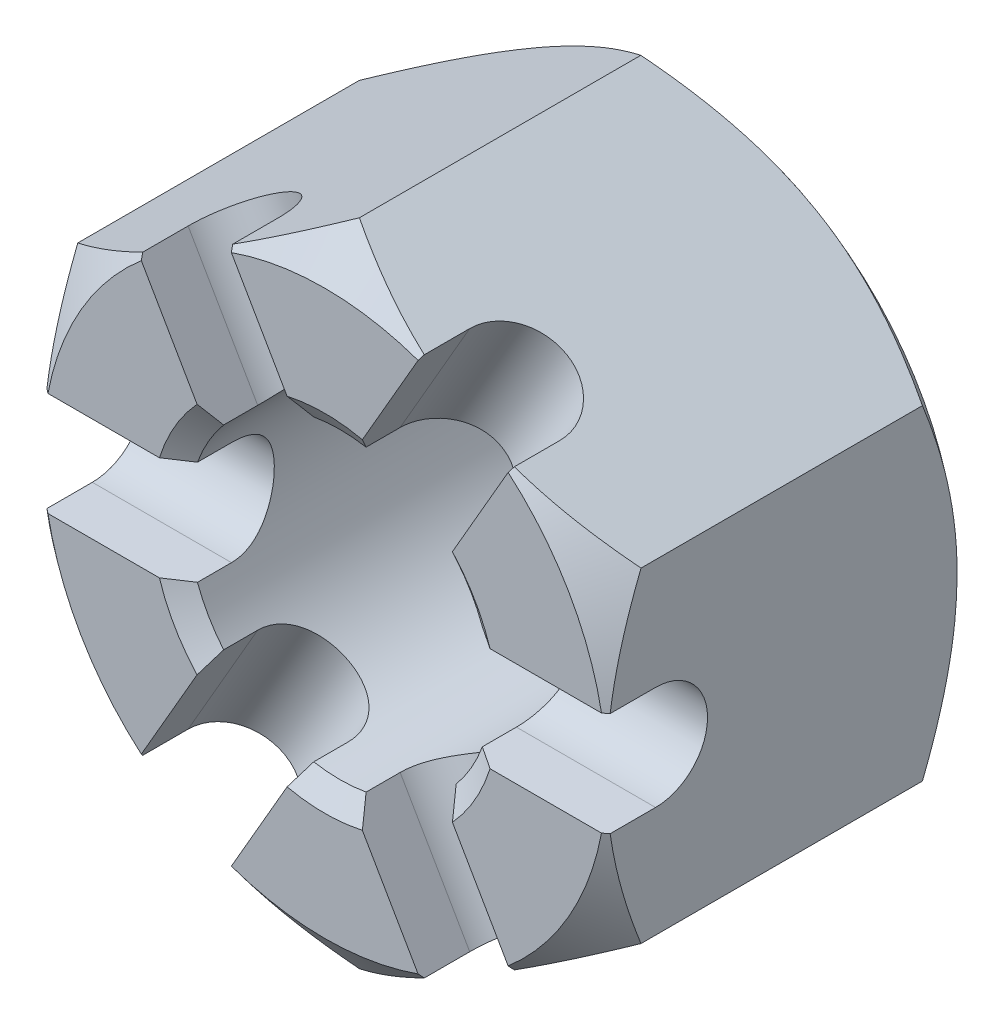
from build123d import *

# Parameters (mm, degrees)
BASENUT_START     = -25.7048
BASENUTSKE_R      = 11.1125
BASENUT_DEPTH     = 25.7048
SLOT_DEPTH        = 55.150139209
SLOTPATTERN_COUNT = 3
SLOTPATTERN_ANGLE = 120


with BuildPart() as part:
    # BaseNutSke → BaseNut (new body)
    with BuildSketch(Plane.XY.offset(BASENUT_START)):
        Polygon((20.6375, 11.91506618), (20.6375, -11.91506618), (0, -23.830132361), (-20.6375, -11.91506618), (-20.6375, 11.91506618), (0, 23.830132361), align=None)
        Circle(BASENUTSKE_R, mode=Mode.SUBTRACT)
    extrude(amount=BASENUT_DEPTH)

    # Sketch4 → Slot (cut, through all)
    with BuildSketch(Plane(origin=(20.6375, 0, 0), x_dir=(0, 0, -1), z_dir=(1, 0, 0))):
        with BuildLine():
            Line((3.6068, 3.81), (0, 3.81))
            Line((0, 3.81), (0, -3.81))
            Line((0, -3.81), (3.6068, -3.81))
            ThreePointArc((3.6068, -3.81), (7.4168, 0), (3.6068, 3.81))
        make_face()
    slot = extrude(amount=-SLOT_DEPTH, mode=Mode.SUBTRACT)

    # SlotPattern: Slot ×3 about axis
    slotpattern_axis = Axis((0, 0, 0), (0, 0, 1))
    for i in range(1, SLOTPATTERN_COUNT):
        add(slot.rotate(slotpattern_axis, i * SLOTPATTERN_ANGLE / (SLOTPATTERN_COUNT - 1)), mode=Mode.SUBTRACT)

    # Sketch3 → Double-Chamfer (revolve, cut)
    with BuildSketch(Plane(origin=(0, 0, 0), x_dir=(0, 0, -1), z_dir=(1, 0, 0)), mode=Mode.PRIVATE) as double_chamfer_sk:
        Polygon((25.7048, 20.6375), (23.1648, 23.830132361), (23.1648, 36.530132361), (38.4048, 36.530132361), (38.4048, 20.6375), align=None)
        Polygon((2.54, 23.830132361), (2.54, 36.530132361), (-12.7, 36.530132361), (-12.7, 20.6375), (0, 20.6375), align=None)
    revolve(double_chamfer_sk.sketch.rotate(Axis((0, 0, 0), (0, 0, -1)), 90), axis=Axis((0, 0, 0), (0, 0, -1)), mode=Mode.SUBTRACT)

    # EndChamferSketch → EndChamfer (revolve, cut)
    with BuildSketch(Plane(origin=(0, 0, 0), x_dir=(0, 0, -1), z_dir=(1, 0, 0)), mode=Mode.PRIVATE) as endchamfer_sk:
        Polygon((25.6794, 12.7), (24.456662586, 10.95375), (25.7302, 10.95375), (25.7302, 12.7), align=None)
        Polygon((-0.0508, 12.7), (0, 12.7), (1.222737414, 10.95375), (-0.0508, 10.95375), align=None)
    revolve(endchamfer_sk.sketch.rotate(Axis((0, 0, -25.037505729), (0, 0, -1)), 69.948957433), axis=Axis((0, 0, -25.037505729), (0, 0, -1)), mode=Mode.SUBTRACT)


solid = part.part
